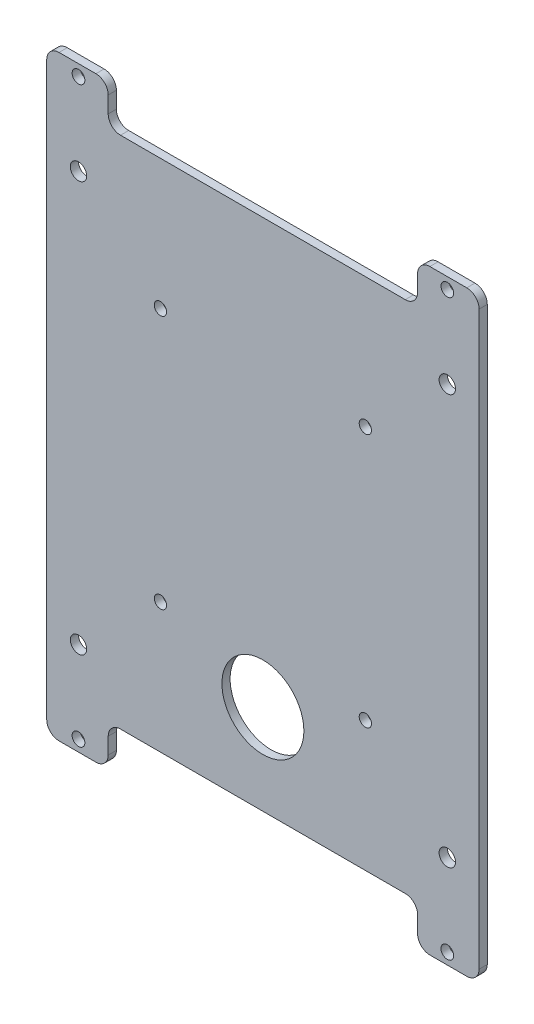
ISO-10303-21;
HEADER;
FILE_DESCRIPTION(('STEP AP214'),'2;1');
FILE_NAME('part.step','',(''),(''),'','','');
FILE_SCHEMA(('AUTOMOTIVE_DESIGN { 1 0 10303 214 1 1 1 1 }'));
ENDSEC;
DATA;
#1=APPLICATION_CONTEXT('core data for automotive mechanical design processes');
#2=APPLICATION_PROTOCOL_DEFINITION('international standard','automotive_design',2000,#1);
#3=PRODUCT_CONTEXT('',#1,'mechanical');
#4=PRODUCT('Part','Part','',(#3));
#5=PRODUCT_RELATED_PRODUCT_CATEGORY('part','',(#4));
#6=PRODUCT_DEFINITION_FORMATION('','',#4);
#7=PRODUCT_DEFINITION_CONTEXT('part definition',#1,'design');
#8=PRODUCT_DEFINITION('design','',#6,#7);
#9=PRODUCT_DEFINITION_SHAPE('','',#8);
#10=(LENGTH_UNIT() NAMED_UNIT(*) SI_UNIT(.MILLI.,.METRE.));
#11=(NAMED_UNIT(*) PLANE_ANGLE_UNIT() SI_UNIT($,.RADIAN.));
#12=(NAMED_UNIT(*) SI_UNIT($,.STERADIAN.) SOLID_ANGLE_UNIT());
#13=UNCERTAINTY_MEASURE_WITH_UNIT(LENGTH_MEASURE(1.E-05),#10,'distance_accuracy_value','');
#14=(GEOMETRIC_REPRESENTATION_CONTEXT(3) GLOBAL_UNCERTAINTY_ASSIGNED_CONTEXT((#13)) GLOBAL_UNIT_ASSIGNED_CONTEXT((#10,
#11,#12)) REPRESENTATION_CONTEXT('',''));
#15=CARTESIAN_POINT('',(0.,0.,0.));
#16=DIRECTION('',(0.,0.,1.));
#17=DIRECTION('',(1.,0.,0.));
#18=AXIS2_PLACEMENT_3D('',#15,#16,#17);
#19=CARTESIAN_POINT('',(-52.75,-72.75,-106.180271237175));
#20=DIRECTION('',(0.,-1.,0.));
#21=DIRECTION('',(0.,0.,-1.));
#22=AXIS2_PLACEMENT_3D('',#19,#20,#21);
#23=PLANE('',#22);
#24=DIRECTION('',(1.,0.,0.));
#25=VECTOR('',#24,1.);
#26=CARTESIAN_POINT('',(-52.75,-72.75,0.));
#27=LINE('',#26,#25);
#28=CARTESIAN_POINT('',(-49.75,-72.75,0.));
#29=VERTEX_POINT('',#28);
#30=CARTESIAN_POINT('',(-40.75,-72.75,0.));
#31=VERTEX_POINT('',#30);
#32=EDGE_CURVE('E219',#29,#31,#27,.T.);
#33=ORIENTED_EDGE('',*,*,#32,.T.);
#34=DIRECTION('',(0.,0.,-1.));
#35=VECTOR('',#34,1.);
#36=CARTESIAN_POINT('',(-40.75,-72.75,2.));
#37=LINE('',#36,#35);
#38=CARTESIAN_POINT('',(-40.75,-72.75,2.));
#39=VERTEX_POINT('',#38);
#40=EDGE_CURVE('E248',#31,#39,#37,.F.);
#41=ORIENTED_EDGE('',*,*,#40,.T.);
#42=DIRECTION('',(1.,0.,0.));
#43=VECTOR('',#42,1.);
#44=CARTESIAN_POINT('',(-52.75,-72.75,2.));
#45=LINE('',#44,#43);
#46=CARTESIAN_POINT('',(-49.75,-72.75,2.));
#47=VERTEX_POINT('',#46);
#48=EDGE_CURVE('E375',#47,#39,#45,.T.);
#49=ORIENTED_EDGE('',*,*,#48,.F.);
#50=DIRECTION('',(0.,0.,1.));
#51=VECTOR('',#50,1.);
#52=CARTESIAN_POINT('',(-49.75,-72.75,0.));
#53=LINE('',#52,#51);
#54=EDGE_CURVE('E246',#47,#29,#53,.F.);
#55=ORIENTED_EDGE('',*,*,#54,.T.);
#56=EDGE_LOOP('',(#33,#41,#49,#55));
#57=FACE_BOUND('',#56,.T.);
#58=ADVANCED_FACE('F36',(#57),#23,.T.);
#59=CARTESIAN_POINT('',(-52.75,72.75,-106.180271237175));
#60=DIRECTION('',(0.,1.,0.));
#61=DIRECTION('',(-1.,0.,0.));
#62=AXIS2_PLACEMENT_3D('',#59,#60,#61);
#63=PLANE('',#62);
#64=DIRECTION('',(-1.,0.,0.));
#65=VECTOR('',#64,1.);
#66=CARTESIAN_POINT('',(-52.75,72.75,2.));
#67=LINE('',#66,#65);
#68=CARTESIAN_POINT('',(-40.75,72.75,2.));
#69=VERTEX_POINT('',#68);
#70=CARTESIAN_POINT('',(-49.75,72.75,2.));
#71=VERTEX_POINT('',#70);
#72=EDGE_CURVE('E471',#69,#71,#67,.T.);
#73=ORIENTED_EDGE('',*,*,#72,.F.);
#74=DIRECTION('',(0.,0.,1.));
#75=VECTOR('',#74,1.);
#76=CARTESIAN_POINT('',(-40.75,72.75,0.));
#77=LINE('',#76,#75);
#78=CARTESIAN_POINT('',(-40.75,72.75,0.));
#79=VERTEX_POINT('',#78);
#80=EDGE_CURVE('E278',#69,#79,#77,.F.);
#81=ORIENTED_EDGE('',*,*,#80,.T.);
#82=DIRECTION('',(-1.,0.,0.));
#83=VECTOR('',#82,1.);
#84=CARTESIAN_POINT('',(-52.75,72.75,0.));
#85=LINE('',#84,#83);
#86=CARTESIAN_POINT('',(-49.75,72.75,0.));
#87=VERTEX_POINT('',#86);
#88=EDGE_CURVE('E607',#79,#87,#85,.T.);
#89=ORIENTED_EDGE('',*,*,#88,.T.);
#90=DIRECTION('',(0.,0.,1.));
#91=VECTOR('',#90,1.);
#92=CARTESIAN_POINT('',(-49.75,72.75,2.));
#93=LINE('',#92,#91);
#94=EDGE_CURVE('E275',#87,#71,#93,.T.);
#95=ORIENTED_EDGE('',*,*,#94,.T.);
#96=EDGE_LOOP('',(#73,#81,#89,#95));
#97=FACE_BOUND('',#96,.T.);
#98=ADVANCED_FACE('F501',(#97),#63,.T.);
#99=CARTESIAN_POINT('',(0.,0.,2.));
#100=DIRECTION('',(0.,0.,-1.));
#101=DIRECTION('',(-1.,0.,0.));
#102=AXIS2_PLACEMENT_3D('',#99,#100,#101);
#103=PLANE('',#102);
#104=CARTESIAN_POINT('',(40.75,-72.75,2.));
#105=VERTEX_POINT('',#104);
#106=CARTESIAN_POINT('',(49.75,-72.75,2.));
#107=VERTEX_POINT('',#106);
#108=EDGE_CURVE('E206',#105,#107,#45,.T.);
#109=ORIENTED_EDGE('',*,*,#108,.T.);
#110=CARTESIAN_POINT('',(49.75,-69.75,2.));
#111=DIRECTION('',(0.,0.,-1.));
#112=DIRECTION('',(-1.,0.,0.));
#113=AXIS2_PLACEMENT_3D('',#110,#111,#112);
#114=CIRCLE('',#113,3.);
#115=CARTESIAN_POINT('',(52.75,-69.75,2.));
#116=VERTEX_POINT('',#115);
#117=EDGE_CURVE('E344',#107,#116,#114,.F.);
#118=ORIENTED_EDGE('',*,*,#117,.T.);
#119=DIRECTION('',(0.,1.,0.));
#120=VECTOR('',#119,1.);
#121=CARTESIAN_POINT('',(52.75,-60.75,2.));
#122=LINE('',#121,#120);
#123=CARTESIAN_POINT('',(52.75,69.75,2.));
#124=VERTEX_POINT('',#123);
#125=EDGE_CURVE('E323',#116,#124,#122,.T.);
#126=ORIENTED_EDGE('',*,*,#125,.T.);
#127=CARTESIAN_POINT('',(49.75,69.75,2.));
#128=DIRECTION('',(0.,0.,-1.));
#129=DIRECTION('',(-1.,0.,0.));
#130=AXIS2_PLACEMENT_3D('',#127,#128,#129);
#131=CIRCLE('',#130,3.);
#132=CARTESIAN_POINT('',(49.75,72.75,2.));
#133=VERTEX_POINT('',#132);
#134=EDGE_CURVE('E336',#124,#133,#131,.F.);
#135=ORIENTED_EDGE('',*,*,#134,.T.);
#136=CARTESIAN_POINT('',(40.75,72.75,2.));
#137=VERTEX_POINT('',#136);
#138=EDGE_CURVE('E463',#133,#137,#67,.T.);
#139=ORIENTED_EDGE('',*,*,#138,.T.);
#140=CARTESIAN_POINT('',(40.75,69.75,2.));
#141=DIRECTION('',(0.,0.,-1.));
#142=DIRECTION('',(-1.,0.,0.));
#143=AXIS2_PLACEMENT_3D('',#140,#141,#142);
#144=CIRCLE('',#143,3.);
#145=CARTESIAN_POINT('',(37.75,69.75,2.));
#146=VERTEX_POINT('',#145);
#147=EDGE_CURVE('E334',#137,#146,#144,.F.);
#148=ORIENTED_EDGE('',*,*,#147,.T.);
#149=DIRECTION('',(0.,1.,0.));
#150=VECTOR('',#149,1.);
#151=CARTESIAN_POINT('',(37.75,72.75,2.));
#152=LINE('',#151,#150);
#153=CARTESIAN_POINT('',(37.75,65.75,2.));
#154=VERTEX_POINT('',#153);
#155=EDGE_CURVE('E610',#154,#146,#152,.T.);
#156=ORIENTED_EDGE('',*,*,#155,.F.);
#157=CARTESIAN_POINT('',(34.75,65.75,2.));
#158=DIRECTION('',(0.,0.,-1.));
#159=DIRECTION('',(-1.,0.,0.));
#160=AXIS2_PLACEMENT_3D('',#157,#158,#159);
#161=CIRCLE('',#160,3.);
#162=CARTESIAN_POINT('',(34.75,62.75,2.));
#163=VERTEX_POINT('',#162);
#164=EDGE_CURVE('E287',#154,#163,#161,.T.);
#165=ORIENTED_EDGE('',*,*,#164,.T.);
#166=DIRECTION('',(1.,0.,0.));
#167=VECTOR('',#166,1.);
#168=CARTESIAN_POINT('',(-37.75,62.75,2.));
#169=LINE('',#168,#167);
#170=CARTESIAN_POINT('',(-34.75,62.75,2.));
#171=VERTEX_POINT('',#170);
#172=EDGE_CURVE('E298',#171,#163,#169,.T.);
#173=ORIENTED_EDGE('',*,*,#172,.F.);
#174=CARTESIAN_POINT('',(-34.75,65.75,2.));
#175=DIRECTION('',(0.,0.,-1.));
#176=DIRECTION('',(-1.,0.,0.));
#177=AXIS2_PLACEMENT_3D('',#174,#175,#176);
#178=CIRCLE('',#177,3.);
#179=CARTESIAN_POINT('',(-37.75,65.75,2.));
#180=VERTEX_POINT('',#179);
#181=EDGE_CURVE('E44',#171,#180,#178,.T.);
#182=ORIENTED_EDGE('',*,*,#181,.T.);
#183=DIRECTION('',(0.,-1.,0.));
#184=VECTOR('',#183,1.);
#185=CARTESIAN_POINT('',(-37.75,72.75,2.));
#186=LINE('',#185,#184);
#187=CARTESIAN_POINT('',(-37.75,69.75,2.));
#188=VERTEX_POINT('',#187);
#189=EDGE_CURVE('E296',#188,#180,#186,.T.);
#190=ORIENTED_EDGE('',*,*,#189,.F.);
#191=CARTESIAN_POINT('',(-40.75,69.75,2.));
#192=DIRECTION('',(0.,0.,-1.));
#193=DIRECTION('',(-1.,0.,0.));
#194=AXIS2_PLACEMENT_3D('',#191,#192,#193);
#195=CIRCLE('',#194,3.);
#196=EDGE_CURVE('E332',#188,#69,#195,.F.);
#197=ORIENTED_EDGE('',*,*,#196,.T.);
#198=ORIENTED_EDGE('',*,*,#72,.T.);
#199=CARTESIAN_POINT('',(-49.75,69.75,2.));
#200=DIRECTION('',(0.,0.,-1.));
#201=DIRECTION('',(-1.,0.,0.));
#202=AXIS2_PLACEMENT_3D('',#199,#200,#201);
#203=CIRCLE('',#202,3.);
#204=CARTESIAN_POINT('',(-52.75,69.75,2.));
#205=VERTEX_POINT('',#204);
#206=EDGE_CURVE('E330',#71,#205,#203,.F.);
#207=ORIENTED_EDGE('',*,*,#206,.T.);
#208=DIRECTION('',(0.,-1.,0.));
#209=VECTOR('',#208,1.);
#210=CARTESIAN_POINT('',(-52.75,-60.75,2.));
#211=LINE('',#210,#209);
#212=CARTESIAN_POINT('',(-52.75,-69.75,2.));
#213=VERTEX_POINT('',#212);
#214=EDGE_CURVE('E319',#205,#213,#211,.T.);
#215=ORIENTED_EDGE('',*,*,#214,.T.);
#216=CARTESIAN_POINT('',(-49.75,-69.75,2.));
#217=DIRECTION('',(0.,0.,-1.));
#218=DIRECTION('',(-1.,0.,0.));
#219=AXIS2_PLACEMENT_3D('',#216,#217,#218);
#220=CIRCLE('',#219,3.);
#221=EDGE_CURVE('E338',#213,#47,#220,.F.);
#222=ORIENTED_EDGE('',*,*,#221,.T.);
#223=ORIENTED_EDGE('',*,*,#48,.T.);
#224=CARTESIAN_POINT('',(-40.75,-69.75,2.));
#225=DIRECTION('',(0.,0.,-1.));
#226=DIRECTION('',(-1.,0.,0.));
#227=AXIS2_PLACEMENT_3D('',#224,#225,#226);
#228=CIRCLE('',#227,3.);
#229=CARTESIAN_POINT('',(-37.75,-69.75,2.));
#230=VERTEX_POINT('',#229);
#231=EDGE_CURVE('E340',#39,#230,#228,.F.);
#232=ORIENTED_EDGE('',*,*,#231,.T.);
#233=DIRECTION('',(0.,-1.,0.));
#234=VECTOR('',#233,1.);
#235=CARTESIAN_POINT('',(-37.75,-72.75,2.));
#236=LINE('',#235,#234);
#237=CARTESIAN_POINT('',(-37.75,-65.75,2.));
#238=VERTEX_POINT('',#237);
#239=EDGE_CURVE('E622',#238,#230,#236,.T.);
#240=ORIENTED_EDGE('',*,*,#239,.F.);
#241=CARTESIAN_POINT('',(-34.75,-65.75,2.));
#242=DIRECTION('',(0.,0.,-1.));
#243=DIRECTION('',(-1.,0.,0.));
#244=AXIS2_PLACEMENT_3D('',#241,#242,#243);
#245=CIRCLE('',#244,3.);
#246=CARTESIAN_POINT('',(-34.75,-62.75,2.));
#247=VERTEX_POINT('',#246);
#248=EDGE_CURVE('E283',#238,#247,#245,.T.);
#249=ORIENTED_EDGE('',*,*,#248,.T.);
#250=DIRECTION('',(-1.,0.,0.));
#251=VECTOR('',#250,1.);
#252=CARTESIAN_POINT('',(-37.75,-62.75,2.));
#253=LINE('',#252,#251);
#254=CARTESIAN_POINT('',(34.75,-62.75,2.));
#255=VERTEX_POINT('',#254);
#256=EDGE_CURVE('E625',#255,#247,#253,.T.);
#257=ORIENTED_EDGE('',*,*,#256,.F.);
#258=CARTESIAN_POINT('',(34.75,-65.75,2.));
#259=DIRECTION('',(0.,0.,-1.));
#260=DIRECTION('',(-1.,0.,0.));
#261=AXIS2_PLACEMENT_3D('',#258,#259,#260);
#262=CIRCLE('',#261,3.);
#263=CARTESIAN_POINT('',(37.75,-65.75,2.));
#264=VERTEX_POINT('',#263);
#265=EDGE_CURVE('E280',#255,#264,#262,.T.);
#266=ORIENTED_EDGE('',*,*,#265,.T.);
#267=DIRECTION('',(0.,1.,0.));
#268=VECTOR('',#267,1.);
#269=CARTESIAN_POINT('',(37.75,-72.75,2.));
#270=LINE('',#269,#268);
#271=CARTESIAN_POINT('',(37.75,-69.75,2.));
#272=VERTEX_POINT('',#271);
#273=EDGE_CURVE('E627',#272,#264,#270,.T.);
#274=ORIENTED_EDGE('',*,*,#273,.F.);
#275=CARTESIAN_POINT('',(40.75,-69.75,2.));
#276=DIRECTION('',(0.,0.,-1.));
#277=DIRECTION('',(-1.,0.,0.));
#278=AXIS2_PLACEMENT_3D('',#275,#276,#277);
#279=CIRCLE('',#278,3.);
#280=EDGE_CURVE('E342',#272,#105,#279,.F.);
#281=ORIENTED_EDGE('',*,*,#280,.T.);
#282=EDGE_LOOP('',(#109,#118,#126,#135,#139,#148,#156,#165,#173,#182,#190,#197,#198,#207,#215,
#222,#223,#232,#240,#249,#257,#266,#274,#281));
#283=FACE_BOUND('',#282,.T.);
#284=CARTESIAN_POINT('',(-45.,50.,2.));
#285=DIRECTION('',(0.,0.,1.));
#286=DIRECTION('',(1.,0.,0.));
#287=AXIS2_PLACEMENT_3D('',#284,#285,#286);
#288=CIRCLE('',#287,2.);
#289=CARTESIAN_POINT('',(-43.,50.,2.));
#290=VERTEX_POINT('',#289);
#291=EDGE_CURVE('E445',#290,#290,#288,.T.);
#292=ORIENTED_EDGE('',*,*,#291,.F.);
#293=EDGE_LOOP('',(#292));
#294=FACE_BOUND('',#293,.T.);
#295=CARTESIAN_POINT('',(-25.,31.,2.));
#296=DIRECTION('',(0.,0.,1.));
#297=DIRECTION('',(1.,0.,0.));
#298=AXIS2_PLACEMENT_3D('',#295,#296,#297);
#299=CIRCLE('',#298,1.5);
#300=CARTESIAN_POINT('',(-23.5,31.,2.));
#301=VERTEX_POINT('',#300);
#302=EDGE_CURVE('E439',#301,#301,#299,.T.);
#303=ORIENTED_EDGE('',*,*,#302,.F.);
#304=EDGE_LOOP('',(#303));
#305=FACE_BOUND('',#304,.T.);
#306=CARTESIAN_POINT('',(0.,-40.75,2.));
#307=DIRECTION('',(0.,0.,1.));
#308=DIRECTION('',(1.,0.,0.));
#309=AXIS2_PLACEMENT_3D('',#306,#307,#308);
#310=CIRCLE('',#309,10.);
#311=CARTESIAN_POINT('',(10.,-40.75,2.));
#312=VERTEX_POINT('',#311);
#313=EDGE_CURVE('E433',#312,#312,#310,.T.);
#314=ORIENTED_EDGE('',*,*,#313,.F.);
#315=EDGE_LOOP('',(#314));
#316=FACE_BOUND('',#315,.T.);
#317=CARTESIAN_POINT('',(45.,50.,2.));
#318=DIRECTION('',(0.,0.,1.));
#319=DIRECTION('',(1.,0.,0.));
#320=AXIS2_PLACEMENT_3D('',#317,#318,#319);
#321=CIRCLE('',#320,2.);
#322=CARTESIAN_POINT('',(47.,50.,2.));
#323=VERTEX_POINT('',#322);
#324=EDGE_CURVE('E427',#323,#323,#321,.T.);
#325=ORIENTED_EDGE('',*,*,#324,.F.);
#326=EDGE_LOOP('',(#325));
#327=FACE_BOUND('',#326,.T.);
#328=CARTESIAN_POINT('',(45.000000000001,-50.,2.));
#329=DIRECTION('',(0.,0.,1.));
#330=DIRECTION('',(1.,0.,0.));
#331=AXIS2_PLACEMENT_3D('',#328,#329,#330);
#332=CIRCLE('',#331,2.);
#333=CARTESIAN_POINT('',(47.000000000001,-50.,2.));
#334=VERTEX_POINT('',#333);
#335=EDGE_CURVE('E421',#334,#334,#332,.T.);
#336=ORIENTED_EDGE('',*,*,#335,.F.);
#337=EDGE_LOOP('',(#336));
#338=FACE_BOUND('',#337,.T.);
#339=CARTESIAN_POINT('',(-44.999999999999,-50.,2.));
#340=DIRECTION('',(0.,0.,1.));
#341=DIRECTION('',(1.,0.,0.));
#342=AXIS2_PLACEMENT_3D('',#339,#340,#341);
#343=CIRCLE('',#342,2.);
#344=CARTESIAN_POINT('',(-42.999999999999,-50.,2.));
#345=VERTEX_POINT('',#344);
#346=EDGE_CURVE('E415',#345,#345,#343,.T.);
#347=ORIENTED_EDGE('',*,*,#346,.F.);
#348=EDGE_LOOP('',(#347));
#349=FACE_BOUND('',#348,.T.);
#350=CARTESIAN_POINT('',(25.,31.,2.));
#351=DIRECTION('',(0.,0.,1.));
#352=DIRECTION('',(1.,0.,0.));
#353=AXIS2_PLACEMENT_3D('',#350,#351,#352);
#354=CIRCLE('',#353,1.5);
#355=CARTESIAN_POINT('',(26.5,31.,2.));
#356=VERTEX_POINT('',#355);
#357=EDGE_CURVE('E409',#356,#356,#354,.T.);
#358=ORIENTED_EDGE('',*,*,#357,.F.);
#359=EDGE_LOOP('',(#358));
#360=FACE_BOUND('',#359,.T.);
#361=CARTESIAN_POINT('',(25.0000000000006,-31.,2.));
#362=DIRECTION('',(0.,0.,1.));
#363=DIRECTION('',(1.,0.,0.));
#364=AXIS2_PLACEMENT_3D('',#361,#362,#363);
#365=CIRCLE('',#364,1.5);
#366=CARTESIAN_POINT('',(26.5000000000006,-31.,2.));
#367=VERTEX_POINT('',#366);
#368=EDGE_CURVE('E403',#367,#367,#365,.T.);
#369=ORIENTED_EDGE('',*,*,#368,.F.);
#370=EDGE_LOOP('',(#369));
#371=FACE_BOUND('',#370,.T.);
#372=CARTESIAN_POINT('',(-24.9999999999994,-31.,2.));
#373=DIRECTION('',(0.,0.,1.));
#374=DIRECTION('',(1.,0.,0.));
#375=AXIS2_PLACEMENT_3D('',#372,#373,#374);
#376=CIRCLE('',#375,1.5);
#377=CARTESIAN_POINT('',(-23.4999999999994,-31.,2.));
#378=VERTEX_POINT('',#377);
#379=EDGE_CURVE('E397',#378,#378,#376,.T.);
#380=ORIENTED_EDGE('',*,*,#379,.F.);
#381=EDGE_LOOP('',(#380));
#382=FACE_BOUND('',#381,.T.);
#383=CARTESIAN_POINT('',(45.000000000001,-70.,2.));
#384=DIRECTION('',(0.,0.,1.));
#385=DIRECTION('',(1.,0.,0.));
#386=AXIS2_PLACEMENT_3D('',#383,#384,#385);
#387=CIRCLE('',#386,1.55);
#388=CARTESIAN_POINT('',(46.550000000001,-70.,2.));
#389=VERTEX_POINT('',#388);
#390=EDGE_CURVE('E384',#389,#389,#387,.T.);
#391=ORIENTED_EDGE('',*,*,#390,.F.);
#392=EDGE_LOOP('',(#391));
#393=FACE_BOUND('',#392,.T.);
#394=CARTESIAN_POINT('',(-44.999999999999,-70.,2.));
#395=DIRECTION('',(0.,0.,1.));
#396=DIRECTION('',(1.,0.,0.));
#397=AXIS2_PLACEMENT_3D('',#394,#395,#396);
#398=CIRCLE('',#397,1.55);
#399=CARTESIAN_POINT('',(-43.449999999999,-70.,2.));
#400=VERTEX_POINT('',#399);
#401=EDGE_CURVE('E389',#400,#400,#398,.T.);
#402=ORIENTED_EDGE('',*,*,#401,.F.);
#403=EDGE_LOOP('',(#402));
#404=FACE_BOUND('',#403,.T.);
#405=CARTESIAN_POINT('',(-44.999999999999,70.,2.));
#406=DIRECTION('',(0.,0.,1.));
#407=DIRECTION('',(-1.,0.,0.));
#408=AXIS2_PLACEMENT_3D('',#405,#406,#407);
#409=CIRCLE('',#408,1.55);
#410=CARTESIAN_POINT('',(-46.549999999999,70.,2.));
#411=VERTEX_POINT('',#410);
#412=EDGE_CURVE('E475',#411,#411,#409,.T.);
#413=ORIENTED_EDGE('',*,*,#412,.F.);
#414=EDGE_LOOP('',(#413));
#415=FACE_BOUND('',#414,.T.);
#416=CARTESIAN_POINT('',(45.000000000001,70.,2.));
#417=DIRECTION('',(0.,0.,1.));
#418=DIRECTION('',(-1.,0.,0.));
#419=AXIS2_PLACEMENT_3D('',#416,#417,#418);
#420=CIRCLE('',#419,1.55);
#421=CARTESIAN_POINT('',(43.450000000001,70.,2.));
#422=VERTEX_POINT('',#421);
#423=EDGE_CURVE('E479',#422,#422,#420,.T.);
#424=ORIENTED_EDGE('',*,*,#423,.F.);
#425=EDGE_LOOP('',(#424));
#426=FACE_BOUND('',#425,.T.);
#427=ADVANCED_FACE('F294',(#283,#294,#305,#316,#327,#338,#349,#360,#371,#382,#393,#404,#415,
#426),#103,.F.);
#428=CARTESIAN_POINT('',(0.,0.,0.));
#429=DIRECTION('',(0.,0.,-1.));
#430=DIRECTION('',(-1.,0.,0.));
#431=AXIS2_PLACEMENT_3D('',#428,#429,#430);
#432=PLANE('',#431);
#433=DIRECTION('',(0.,1.,0.));
#434=VECTOR('',#433,1.);
#435=CARTESIAN_POINT('',(52.75,-60.75,0.));
#436=LINE('',#435,#434);
#437=CARTESIAN_POINT('',(52.75,-69.75,0.));
#438=VERTEX_POINT('',#437);
#439=CARTESIAN_POINT('',(52.75,69.75,0.));
#440=VERTEX_POINT('',#439);
#441=EDGE_CURVE('E371',#438,#440,#436,.T.);
#442=ORIENTED_EDGE('',*,*,#441,.F.);
#443=CARTESIAN_POINT('',(49.75,-69.75,0.));
#444=DIRECTION('',(0.,0.,-1.));
#445=DIRECTION('',(-1.,0.,0.));
#446=AXIS2_PLACEMENT_3D('',#443,#444,#445);
#447=CIRCLE('',#446,3.);
#448=CARTESIAN_POINT('',(49.75,-72.75,0.));
#449=VERTEX_POINT('',#448);
#450=EDGE_CURVE('E218',#438,#449,#447,.T.);
#451=ORIENTED_EDGE('',*,*,#450,.T.);
#452=CARTESIAN_POINT('',(40.75,-72.75,0.));
#453=VERTEX_POINT('',#452);
#454=EDGE_CURVE('E203',#453,#449,#27,.T.);
#455=ORIENTED_EDGE('',*,*,#454,.F.);
#456=CARTESIAN_POINT('',(40.75,-69.75,0.));
#457=DIRECTION('',(0.,0.,-1.));
#458=DIRECTION('',(-1.,0.,0.));
#459=AXIS2_PLACEMENT_3D('',#456,#457,#458);
#460=CIRCLE('',#459,3.);
#461=CARTESIAN_POINT('',(37.75,-69.75,0.));
#462=VERTEX_POINT('',#461);
#463=EDGE_CURVE('E215',#453,#462,#460,.T.);
#464=ORIENTED_EDGE('',*,*,#463,.T.);
#465=DIRECTION('',(0.,-1.,0.));
#466=VECTOR('',#465,1.);
#467=CARTESIAN_POINT('',(37.75,0.,0.));
#468=LINE('',#467,#466);
#469=CARTESIAN_POINT('',(37.75,-65.75,0.));
#470=VERTEX_POINT('',#469);
#471=EDGE_CURVE('E620',#470,#462,#468,.T.);
#472=ORIENTED_EDGE('',*,*,#471,.F.);
#473=CARTESIAN_POINT('',(34.75,-65.75,0.));
#474=DIRECTION('',(0.,0.,-1.));
#475=DIRECTION('',(-1.,0.,0.));
#476=AXIS2_PLACEMENT_3D('',#473,#474,#475);
#477=CIRCLE('',#476,3.);
#478=CARTESIAN_POINT('',(34.75,-62.75,0.));
#479=VERTEX_POINT('',#478);
#480=EDGE_CURVE('E51',#470,#479,#477,.F.);
#481=ORIENTED_EDGE('',*,*,#480,.T.);
#482=DIRECTION('',(1.,0.,0.));
#483=VECTOR('',#482,1.);
#484=CARTESIAN_POINT('',(0.,-62.75,0.));
#485=LINE('',#484,#483);
#486=CARTESIAN_POINT('',(-34.75,-62.75,0.));
#487=VERTEX_POINT('',#486);
#488=EDGE_CURVE('E210',#487,#479,#485,.T.);
#489=ORIENTED_EDGE('',*,*,#488,.F.);
#490=CARTESIAN_POINT('',(-34.75,-65.75,0.));
#491=DIRECTION('',(0.,0.,-1.));
#492=DIRECTION('',(-1.,0.,0.));
#493=AXIS2_PLACEMENT_3D('',#490,#491,#492);
#494=CIRCLE('',#493,3.);
#495=CARTESIAN_POINT('',(-37.75,-65.75,0.));
#496=VERTEX_POINT('',#495);
#497=EDGE_CURVE('E285',#487,#496,#494,.F.);
#498=ORIENTED_EDGE('',*,*,#497,.T.);
#499=DIRECTION('',(0.,1.,0.));
#500=VECTOR('',#499,1.);
#501=CARTESIAN_POINT('',(-37.75,0.,0.));
#502=LINE('',#501,#500);
#503=CARTESIAN_POINT('',(-37.75,-69.75,0.));
#504=VERTEX_POINT('',#503);
#505=EDGE_CURVE('E307',#504,#496,#502,.T.);
#506=ORIENTED_EDGE('',*,*,#505,.F.);
#507=CARTESIAN_POINT('',(-40.75,-69.75,0.));
#508=DIRECTION('',(0.,0.,-1.));
#509=DIRECTION('',(-1.,0.,0.));
#510=AXIS2_PLACEMENT_3D('',#507,#508,#509);
#511=CIRCLE('',#510,3.);
#512=EDGE_CURVE('E226',#504,#31,#511,.T.);
#513=ORIENTED_EDGE('',*,*,#512,.T.);
#514=ORIENTED_EDGE('',*,*,#32,.F.);
#515=CARTESIAN_POINT('',(-49.75,-69.75,0.));
#516=DIRECTION('',(0.,0.,-1.));
#517=DIRECTION('',(-1.,0.,0.));
#518=AXIS2_PLACEMENT_3D('',#515,#516,#517);
#519=CIRCLE('',#518,3.);
#520=CARTESIAN_POINT('',(-52.75,-69.75,0.));
#521=VERTEX_POINT('',#520);
#522=EDGE_CURVE('E230',#29,#521,#519,.T.);
#523=ORIENTED_EDGE('',*,*,#522,.T.);
#524=DIRECTION('',(0.,-1.,0.));
#525=VECTOR('',#524,1.);
#526=CARTESIAN_POINT('',(-52.75,-60.75,0.));
#527=LINE('',#526,#525);
#528=CARTESIAN_POINT('',(-52.75,69.75,0.));
#529=VERTEX_POINT('',#528);
#530=EDGE_CURVE('E326',#529,#521,#527,.T.);
#531=ORIENTED_EDGE('',*,*,#530,.F.);
#532=CARTESIAN_POINT('',(-49.75,69.75,0.));
#533=DIRECTION('',(0.,0.,-1.));
#534=DIRECTION('',(-1.,0.,0.));
#535=AXIS2_PLACEMENT_3D('',#532,#533,#534);
#536=CIRCLE('',#535,3.);
#537=EDGE_CURVE('E351',#529,#87,#536,.T.);
#538=ORIENTED_EDGE('',*,*,#537,.T.);
#539=ORIENTED_EDGE('',*,*,#88,.F.);
#540=CARTESIAN_POINT('',(-40.75,69.75,0.));
#541=DIRECTION('',(0.,0.,-1.));
#542=DIRECTION('',(-1.,0.,0.));
#543=AXIS2_PLACEMENT_3D('',#540,#541,#542);
#544=CIRCLE('',#543,3.);
#545=CARTESIAN_POINT('',(-37.75,69.75,0.));
#546=VERTEX_POINT('',#545);
#547=EDGE_CURVE('E353',#79,#546,#544,.T.);
#548=ORIENTED_EDGE('',*,*,#547,.T.);
#549=DIRECTION('',(0.,1.,0.));
#550=VECTOR('',#549,1.);
#551=CARTESIAN_POINT('',(-37.75,0.,0.));
#552=LINE('',#551,#550);
#553=CARTESIAN_POINT('',(-37.75,65.75,0.));
#554=VERTEX_POINT('',#553);
#555=EDGE_CURVE('E315',#554,#546,#552,.T.);
#556=ORIENTED_EDGE('',*,*,#555,.F.);
#557=CARTESIAN_POINT('',(-34.75,65.75,0.));
#558=DIRECTION('',(0.,0.,-1.));
#559=DIRECTION('',(-1.,0.,0.));
#560=AXIS2_PLACEMENT_3D('',#557,#558,#559);
#561=CIRCLE('',#560,3.);
#562=CARTESIAN_POINT('',(-34.75,62.75,0.));
#563=VERTEX_POINT('',#562);
#564=EDGE_CURVE('E11',#554,#563,#561,.F.);
#565=ORIENTED_EDGE('',*,*,#564,.T.);
#566=DIRECTION('',(-1.,0.,0.));
#567=VECTOR('',#566,1.);
#568=CARTESIAN_POINT('',(0.,62.75,0.));
#569=LINE('',#568,#567);
#570=CARTESIAN_POINT('',(34.75,62.75,0.));
#571=VERTEX_POINT('',#570);
#572=EDGE_CURVE('E313',#571,#563,#569,.T.);
#573=ORIENTED_EDGE('',*,*,#572,.F.);
#574=CARTESIAN_POINT('',(34.75,65.75,0.));
#575=DIRECTION('',(0.,0.,-1.));
#576=DIRECTION('',(-1.,0.,0.));
#577=AXIS2_PLACEMENT_3D('',#574,#575,#576);
#578=CIRCLE('',#577,3.);
#579=CARTESIAN_POINT('',(37.75,65.75,0.));
#580=VERTEX_POINT('',#579);
#581=EDGE_CURVE('E289',#571,#580,#578,.F.);
#582=ORIENTED_EDGE('',*,*,#581,.T.);
#583=DIRECTION('',(0.,-1.,0.));
#584=VECTOR('',#583,1.);
#585=CARTESIAN_POINT('',(37.75,0.,0.));
#586=LINE('',#585,#584);
#587=CARTESIAN_POINT('',(37.75,69.75,0.));
#588=VERTEX_POINT('',#587);
#589=EDGE_CURVE('E608',#588,#580,#586,.T.);
#590=ORIENTED_EDGE('',*,*,#589,.F.);
#591=CARTESIAN_POINT('',(40.75,69.75,0.));
#592=DIRECTION('',(0.,0.,-1.));
#593=DIRECTION('',(-1.,0.,0.));
#594=AXIS2_PLACEMENT_3D('',#591,#592,#593);
#595=CIRCLE('',#594,3.);
#596=CARTESIAN_POINT('',(40.75,72.75,0.));
#597=VERTEX_POINT('',#596);
#598=EDGE_CURVE('E355',#588,#597,#595,.T.);
#599=ORIENTED_EDGE('',*,*,#598,.T.);
#600=CARTESIAN_POINT('',(49.75,72.75,0.));
#601=VERTEX_POINT('',#600);
#602=EDGE_CURVE('E387',#601,#597,#85,.T.);
#603=ORIENTED_EDGE('',*,*,#602,.F.);
#604=CARTESIAN_POINT('',(49.75,69.75,0.));
#605=DIRECTION('',(0.,0.,-1.));
#606=DIRECTION('',(-1.,0.,0.));
#607=AXIS2_PLACEMENT_3D('',#604,#605,#606);
#608=CIRCLE('',#607,3.);
#609=EDGE_CURVE('E357',#601,#440,#608,.T.);
#610=ORIENTED_EDGE('',*,*,#609,.T.);
#611=EDGE_LOOP('',(#442,#451,#455,#464,#472,#481,#489,#498,#506,#513,#514,#523,#531,#538,#539,
#548,#556,#565,#573,#582,#590,#599,#603,#610));
#612=FACE_BOUND('',#611,.T.);
#613=CARTESIAN_POINT('',(25.0000000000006,-31.,0.));
#614=DIRECTION('',(0.,0.,1.));
#615=DIRECTION('',(1.,0.,0.));
#616=AXIS2_PLACEMENT_3D('',#613,#614,#615);
#617=CIRCLE('',#616,1.5);
#618=CARTESIAN_POINT('',(26.5000000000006,-31.,0.));
#619=VERTEX_POINT('',#618);
#620=EDGE_CURVE('E400',#619,#619,#617,.T.);
#621=ORIENTED_EDGE('',*,*,#620,.T.);
#622=EDGE_LOOP('',(#621));
#623=FACE_BOUND('',#622,.T.);
#624=CARTESIAN_POINT('',(-44.999999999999,-50.,0.));
#625=DIRECTION('',(0.,0.,1.));
#626=DIRECTION('',(1.,0.,0.));
#627=AXIS2_PLACEMENT_3D('',#624,#625,#626);
#628=CIRCLE('',#627,2.);
#629=CARTESIAN_POINT('',(-42.999999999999,-50.,0.));
#630=VERTEX_POINT('',#629);
#631=EDGE_CURVE('E412',#630,#630,#628,.T.);
#632=ORIENTED_EDGE('',*,*,#631,.T.);
#633=EDGE_LOOP('',(#632));
#634=FACE_BOUND('',#633,.T.);
#635=CARTESIAN_POINT('',(45.,50.,0.));
#636=DIRECTION('',(0.,0.,1.));
#637=DIRECTION('',(1.,0.,0.));
#638=AXIS2_PLACEMENT_3D('',#635,#636,#637);
#639=CIRCLE('',#638,2.);
#640=CARTESIAN_POINT('',(47.,50.,0.));
#641=VERTEX_POINT('',#640);
#642=EDGE_CURVE('E424',#641,#641,#639,.T.);
#643=ORIENTED_EDGE('',*,*,#642,.T.);
#644=EDGE_LOOP('',(#643));
#645=FACE_BOUND('',#644,.T.);
#646=CARTESIAN_POINT('',(-25.,31.,0.));
#647=DIRECTION('',(0.,0.,1.));
#648=DIRECTION('',(1.,0.,0.));
#649=AXIS2_PLACEMENT_3D('',#646,#647,#648);
#650=CIRCLE('',#649,1.5);
#651=CARTESIAN_POINT('',(-23.5,31.,0.));
#652=VERTEX_POINT('',#651);
#653=EDGE_CURVE('E436',#652,#652,#650,.T.);
#654=ORIENTED_EDGE('',*,*,#653,.T.);
#655=EDGE_LOOP('',(#654));
#656=FACE_BOUND('',#655,.T.);
#657=CARTESIAN_POINT('',(-45.,50.,0.));
#658=DIRECTION('',(0.,0.,1.));
#659=DIRECTION('',(1.,0.,0.));
#660=AXIS2_PLACEMENT_3D('',#657,#658,#659);
#661=CIRCLE('',#660,2.);
#662=CARTESIAN_POINT('',(-43.,50.,0.));
#663=VERTEX_POINT('',#662);
#664=EDGE_CURVE('E442',#663,#663,#661,.T.);
#665=ORIENTED_EDGE('',*,*,#664,.T.);
#666=EDGE_LOOP('',(#665));
#667=FACE_BOUND('',#666,.T.);
#668=CARTESIAN_POINT('',(0.,-40.75,0.));
#669=DIRECTION('',(0.,0.,1.));
#670=DIRECTION('',(1.,0.,0.));
#671=AXIS2_PLACEMENT_3D('',#668,#669,#670);
#672=CIRCLE('',#671,10.);
#673=CARTESIAN_POINT('',(10.,-40.75,0.));
#674=VERTEX_POINT('',#673);
#675=EDGE_CURVE('E430',#674,#674,#672,.T.);
#676=ORIENTED_EDGE('',*,*,#675,.T.);
#677=EDGE_LOOP('',(#676));
#678=FACE_BOUND('',#677,.T.);
#679=CARTESIAN_POINT('',(45.000000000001,-50.,0.));
#680=DIRECTION('',(0.,0.,1.));
#681=DIRECTION('',(1.,0.,0.));
#682=AXIS2_PLACEMENT_3D('',#679,#680,#681);
#683=CIRCLE('',#682,2.);
#684=CARTESIAN_POINT('',(47.000000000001,-50.,0.));
#685=VERTEX_POINT('',#684);
#686=EDGE_CURVE('E418',#685,#685,#683,.T.);
#687=ORIENTED_EDGE('',*,*,#686,.T.);
#688=EDGE_LOOP('',(#687));
#689=FACE_BOUND('',#688,.T.);
#690=CARTESIAN_POINT('',(25.,31.,0.));
#691=DIRECTION('',(0.,0.,1.));
#692=DIRECTION('',(1.,0.,0.));
#693=AXIS2_PLACEMENT_3D('',#690,#691,#692);
#694=CIRCLE('',#693,1.5);
#695=CARTESIAN_POINT('',(26.5,31.,0.));
#696=VERTEX_POINT('',#695);
#697=EDGE_CURVE('E406',#696,#696,#694,.T.);
#698=ORIENTED_EDGE('',*,*,#697,.T.);
#699=EDGE_LOOP('',(#698));
#700=FACE_BOUND('',#699,.T.);
#701=CARTESIAN_POINT('',(-24.9999999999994,-31.,0.));
#702=DIRECTION('',(0.,0.,1.));
#703=DIRECTION('',(1.,0.,0.));
#704=AXIS2_PLACEMENT_3D('',#701,#702,#703);
#705=CIRCLE('',#704,1.5);
#706=CARTESIAN_POINT('',(-23.4999999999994,-31.,0.));
#707=VERTEX_POINT('',#706);
#708=EDGE_CURVE('E395',#707,#707,#705,.T.);
#709=ORIENTED_EDGE('',*,*,#708,.T.);
#710=EDGE_LOOP('',(#709));
#711=FACE_BOUND('',#710,.T.);
#712=CARTESIAN_POINT('',(45.000000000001,-70.,0.));
#713=DIRECTION('',(0.,0.,-1.));
#714=DIRECTION('',(-1.,0.,0.));
#715=AXIS2_PLACEMENT_3D('',#712,#713,#714);
#716=CIRCLE('',#715,1.55);
#717=CARTESIAN_POINT('',(43.450000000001,-70.,0.));
#718=VERTEX_POINT('',#717);
#719=EDGE_CURVE('E379',#718,#718,#716,.F.);
#720=ORIENTED_EDGE('',*,*,#719,.T.);
#721=EDGE_LOOP('',(#720));
#722=FACE_BOUND('',#721,.T.);
#723=CARTESIAN_POINT('',(-44.999999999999,-70.,0.));
#724=DIRECTION('',(0.,0.,-1.));
#725=DIRECTION('',(-1.,0.,0.));
#726=AXIS2_PLACEMENT_3D('',#723,#724,#725);
#727=CIRCLE('',#726,1.55);
#728=CARTESIAN_POINT('',(-46.549999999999,-70.,0.));
#729=VERTEX_POINT('',#728);
#730=EDGE_CURVE('E382',#729,#729,#727,.F.);
#731=ORIENTED_EDGE('',*,*,#730,.T.);
#732=EDGE_LOOP('',(#731));
#733=FACE_BOUND('',#732,.T.);
#734=CARTESIAN_POINT('',(-44.999999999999,70.,0.));
#735=DIRECTION('',(0.,0.,-1.));
#736=DIRECTION('',(-1.,0.,0.));
#737=AXIS2_PLACEMENT_3D('',#734,#735,#736);
#738=CIRCLE('',#737,1.55);
#739=CARTESIAN_POINT('',(-46.549999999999,70.,0.));
#740=VERTEX_POINT('',#739);
#741=EDGE_CURVE('E470',#740,#740,#738,.F.);
#742=ORIENTED_EDGE('',*,*,#741,.T.);
#743=EDGE_LOOP('',(#742));
#744=FACE_BOUND('',#743,.T.);
#745=CARTESIAN_POINT('',(45.000000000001,70.,0.));
#746=DIRECTION('',(0.,0.,-1.));
#747=DIRECTION('',(-1.,0.,0.));
#748=AXIS2_PLACEMENT_3D('',#745,#746,#747);
#749=CIRCLE('',#748,1.55);
#750=CARTESIAN_POINT('',(43.450000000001,70.,0.));
#751=VERTEX_POINT('',#750);
#752=EDGE_CURVE('E220',#751,#751,#749,.F.);
#753=ORIENTED_EDGE('',*,*,#752,.T.);
#754=EDGE_LOOP('',(#753));
#755=FACE_BOUND('',#754,.T.);
#756=ADVANCED_FACE('F213',(#612,#623,#634,#645,#656,#667,#678,#689,#700,#711,#722,#733,#744,
#755),#432,.T.);
#757=CARTESIAN_POINT('',(52.75,-60.75,2.));
#758=DIRECTION('',(-1.,0.,0.));
#759=DIRECTION('',(0.,0.,1.));
#760=AXIS2_PLACEMENT_3D('',#757,#758,#759);
#761=PLANE('',#760);
#762=ORIENTED_EDGE('',*,*,#125,.F.);
#763=DIRECTION('',(0.,0.,1.));
#764=VECTOR('',#763,1.);
#765=CARTESIAN_POINT('',(52.75,-69.75,0.));
#766=LINE('',#765,#764);
#767=EDGE_CURVE('E349',#116,#438,#766,.F.);
#768=ORIENTED_EDGE('',*,*,#767,.T.);
#769=ORIENTED_EDGE('',*,*,#441,.T.);
#770=DIRECTION('',(0.,0.,1.));
#771=VECTOR('',#770,1.);
#772=CARTESIAN_POINT('',(52.75,69.75,2.));
#773=LINE('',#772,#771);
#774=EDGE_CURVE('E346',#440,#124,#773,.T.);
#775=ORIENTED_EDGE('',*,*,#774,.T.);
#776=EDGE_LOOP('',(#762,#768,#769,#775));
#777=FACE_BOUND('',#776,.T.);
#778=ADVANCED_FACE('F455',(#777),#761,.F.);
#779=CARTESIAN_POINT('',(-52.75,-60.75,2.));
#780=DIRECTION('',(1.,0.,0.));
#781=DIRECTION('',(0.,0.,-1.));
#782=AXIS2_PLACEMENT_3D('',#779,#780,#781);
#783=PLANE('',#782);
#784=ORIENTED_EDGE('',*,*,#530,.T.);
#785=DIRECTION('',(0.,0.,1.));
#786=VECTOR('',#785,1.);
#787=CARTESIAN_POINT('',(-52.75,-69.75,2.));
#788=LINE('',#787,#786);
#789=EDGE_CURVE('E252',#521,#213,#788,.T.);
#790=ORIENTED_EDGE('',*,*,#789,.T.);
#791=ORIENTED_EDGE('',*,*,#214,.F.);
#792=DIRECTION('',(0.,0.,1.));
#793=VECTOR('',#792,1.);
#794=CARTESIAN_POINT('',(-52.75,69.75,0.));
#795=LINE('',#794,#793);
#796=EDGE_CURVE('E250',#205,#529,#795,.F.);
#797=ORIENTED_EDGE('',*,*,#796,.T.);
#798=EDGE_LOOP('',(#784,#790,#791,#797));
#799=FACE_BOUND('',#798,.T.);
#800=ADVANCED_FACE('F368',(#799),#783,.F.);
#801=CARTESIAN_POINT('',(-45.,50.,2.));
#802=DIRECTION('',(0.,0.,-1.));
#803=DIRECTION('',(-1.,0.,0.));
#804=AXIS2_PLACEMENT_3D('',#801,#802,#803);
#805=CYLINDRICAL_SURFACE('',#804,2.);
#806=ORIENTED_EDGE('',*,*,#291,.T.);
#807=EDGE_LOOP('',(#806));
#808=FACE_BOUND('',#807,.T.);
#809=ORIENTED_EDGE('',*,*,#664,.F.);
#810=EDGE_LOOP('',(#809));
#811=FACE_BOUND('',#810,.T.);
#812=ADVANCED_FACE('F551',(#808,#811),#805,.F.);
#813=CARTESIAN_POINT('',(-25.,31.,2.));
#814=DIRECTION('',(0.,0.,-1.));
#815=DIRECTION('',(-1.,0.,0.));
#816=AXIS2_PLACEMENT_3D('',#813,#814,#815);
#817=CYLINDRICAL_SURFACE('',#816,1.5);
#818=ORIENTED_EDGE('',*,*,#302,.T.);
#819=EDGE_LOOP('',(#818));
#820=FACE_BOUND('',#819,.T.);
#821=ORIENTED_EDGE('',*,*,#653,.F.);
#822=EDGE_LOOP('',(#821));
#823=FACE_BOUND('',#822,.T.);
#824=ADVANCED_FACE('F547',(#820,#823),#817,.F.);
#825=CARTESIAN_POINT('',(0.,-40.75,2.));
#826=DIRECTION('',(0.,0.,-1.));
#827=DIRECTION('',(-1.,0.,0.));
#828=AXIS2_PLACEMENT_3D('',#825,#826,#827);
#829=CYLINDRICAL_SURFACE('',#828,10.);
#830=ORIENTED_EDGE('',*,*,#313,.T.);
#831=EDGE_LOOP('',(#830));
#832=FACE_BOUND('',#831,.T.);
#833=ORIENTED_EDGE('',*,*,#675,.F.);
#834=EDGE_LOOP('',(#833));
#835=FACE_BOUND('',#834,.T.);
#836=ADVANCED_FACE('F543',(#832,#835),#829,.F.);
#837=CARTESIAN_POINT('',(45.,50.,2.));
#838=DIRECTION('',(0.,0.,-1.));
#839=DIRECTION('',(-1.,0.,0.));
#840=AXIS2_PLACEMENT_3D('',#837,#838,#839);
#841=CYLINDRICAL_SURFACE('',#840,2.);
#842=ORIENTED_EDGE('',*,*,#324,.T.);
#843=EDGE_LOOP('',(#842));
#844=FACE_BOUND('',#843,.T.);
#845=ORIENTED_EDGE('',*,*,#642,.F.);
#846=EDGE_LOOP('',(#845));
#847=FACE_BOUND('',#846,.T.);
#848=ADVANCED_FACE('F539',(#844,#847),#841,.F.);
#849=CARTESIAN_POINT('',(45.000000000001,-50.,2.));
#850=DIRECTION('',(0.,0.,-1.));
#851=DIRECTION('',(-1.,0.,0.));
#852=AXIS2_PLACEMENT_3D('',#849,#850,#851);
#853=CYLINDRICAL_SURFACE('',#852,2.);
#854=ORIENTED_EDGE('',*,*,#335,.T.);
#855=EDGE_LOOP('',(#854));
#856=FACE_BOUND('',#855,.T.);
#857=ORIENTED_EDGE('',*,*,#686,.F.);
#858=EDGE_LOOP('',(#857));
#859=FACE_BOUND('',#858,.T.);
#860=ADVANCED_FACE('F535',(#856,#859),#853,.F.);
#861=CARTESIAN_POINT('',(-44.999999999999,-50.,2.));
#862=DIRECTION('',(0.,0.,-1.));
#863=DIRECTION('',(-1.,0.,0.));
#864=AXIS2_PLACEMENT_3D('',#861,#862,#863);
#865=CYLINDRICAL_SURFACE('',#864,2.);
#866=ORIENTED_EDGE('',*,*,#346,.T.);
#867=EDGE_LOOP('',(#866));
#868=FACE_BOUND('',#867,.T.);
#869=ORIENTED_EDGE('',*,*,#631,.F.);
#870=EDGE_LOOP('',(#869));
#871=FACE_BOUND('',#870,.T.);
#872=ADVANCED_FACE('F531',(#868,#871),#865,.F.);
#873=CARTESIAN_POINT('',(25.,31.,2.));
#874=DIRECTION('',(0.,0.,-1.));
#875=DIRECTION('',(-1.,0.,0.));
#876=AXIS2_PLACEMENT_3D('',#873,#874,#875);
#877=CYLINDRICAL_SURFACE('',#876,1.5);
#878=ORIENTED_EDGE('',*,*,#357,.T.);
#879=EDGE_LOOP('',(#878));
#880=FACE_BOUND('',#879,.T.);
#881=ORIENTED_EDGE('',*,*,#697,.F.);
#882=EDGE_LOOP('',(#881));
#883=FACE_BOUND('',#882,.T.);
#884=ADVANCED_FACE('F523',(#880,#883),#877,.F.);
#885=CARTESIAN_POINT('',(25.0000000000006,-31.,2.));
#886=DIRECTION('',(0.,0.,-1.));
#887=DIRECTION('',(-1.,0.,0.));
#888=AXIS2_PLACEMENT_3D('',#885,#886,#887);
#889=CYLINDRICAL_SURFACE('',#888,1.5);
#890=ORIENTED_EDGE('',*,*,#368,.T.);
#891=EDGE_LOOP('',(#890));
#892=FACE_BOUND('',#891,.T.);
#893=ORIENTED_EDGE('',*,*,#620,.F.);
#894=EDGE_LOOP('',(#893));
#895=FACE_BOUND('',#894,.T.);
#896=ADVANCED_FACE('F517',(#892,#895),#889,.F.);
#897=CARTESIAN_POINT('',(-24.9999999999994,-31.,2.));
#898=DIRECTION('',(0.,0.,-1.));
#899=DIRECTION('',(-1.,0.,0.));
#900=AXIS2_PLACEMENT_3D('',#897,#898,#899);
#901=CYLINDRICAL_SURFACE('',#900,1.5);
#902=ORIENTED_EDGE('',*,*,#379,.T.);
#903=EDGE_LOOP('',(#902));
#904=FACE_BOUND('',#903,.T.);
#905=ORIENTED_EDGE('',*,*,#708,.F.);
#906=EDGE_LOOP('',(#905));
#907=FACE_BOUND('',#906,.T.);
#908=ADVANCED_FACE('F511',(#904,#907),#901,.F.);
#909=ORIENTED_EDGE('',*,*,#454,.T.);
#910=DIRECTION('',(0.,0.,1.));
#911=VECTOR('',#910,1.);
#912=CARTESIAN_POINT('',(49.75,-72.75,2.));
#913=LINE('',#912,#911);
#914=EDGE_CURVE('E209',#449,#107,#913,.T.);
#915=ORIENTED_EDGE('',*,*,#914,.T.);
#916=ORIENTED_EDGE('',*,*,#108,.F.);
#917=DIRECTION('',(0.,0.,1.));
#918=VECTOR('',#917,1.);
#919=CARTESIAN_POINT('',(40.75,-72.75,0.));
#920=LINE('',#919,#918);
#921=EDGE_CURVE('E199',#105,#453,#920,.F.);
#922=ORIENTED_EDGE('',*,*,#921,.T.);
#923=EDGE_LOOP('',(#909,#915,#916,#922));
#924=FACE_BOUND('',#923,.T.);
#925=ADVANCED_FACE('F201',(#924),#23,.T.);
#926=CARTESIAN_POINT('',(-44.999999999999,-70.,-106.180271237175));
#927=DIRECTION('',(0.,0.,1.));
#928=DIRECTION('',(1.,0.,0.));
#929=AXIS2_PLACEMENT_3D('',#926,#927,#928);
#930=CYLINDRICAL_SURFACE('',#929,1.55);
#931=ORIENTED_EDGE('',*,*,#401,.T.);
#932=EDGE_LOOP('',(#931));
#933=FACE_BOUND('',#932,.T.);
#934=ORIENTED_EDGE('',*,*,#730,.F.);
#935=EDGE_LOOP('',(#934));
#936=FACE_BOUND('',#935,.T.);
#937=ADVANCED_FACE('F510',(#933,#936),#930,.F.);
#938=CARTESIAN_POINT('',(45.000000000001,-70.,-106.180271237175));
#939=DIRECTION('',(0.,0.,1.));
#940=DIRECTION('',(1.,0.,0.));
#941=AXIS2_PLACEMENT_3D('',#938,#939,#940);
#942=CYLINDRICAL_SURFACE('',#941,1.55);
#943=ORIENTED_EDGE('',*,*,#390,.T.);
#944=EDGE_LOOP('',(#943));
#945=FACE_BOUND('',#944,.T.);
#946=ORIENTED_EDGE('',*,*,#719,.F.);
#947=EDGE_LOOP('',(#946));
#948=FACE_BOUND('',#947,.T.);
#949=ADVANCED_FACE('F499',(#945,#948),#942,.F.);
#950=ORIENTED_EDGE('',*,*,#138,.F.);
#951=DIRECTION('',(0.,0.,1.));
#952=VECTOR('',#951,1.);
#953=CARTESIAN_POINT('',(49.75,72.75,0.));
#954=LINE('',#953,#952);
#955=EDGE_CURVE('E257',#133,#601,#954,.F.);
#956=ORIENTED_EDGE('',*,*,#955,.T.);
#957=ORIENTED_EDGE('',*,*,#602,.T.);
#958=DIRECTION('',(0.,0.,-1.));
#959=VECTOR('',#958,1.);
#960=CARTESIAN_POINT('',(40.75,72.75,2.));
#961=LINE('',#960,#959);
#962=EDGE_CURVE('E255',#597,#137,#961,.F.);
#963=ORIENTED_EDGE('',*,*,#962,.T.);
#964=EDGE_LOOP('',(#950,#956,#957,#963));
#965=FACE_BOUND('',#964,.T.);
#966=ADVANCED_FACE('F466',(#965),#63,.T.);
#967=CARTESIAN_POINT('',(45.000000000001,70.,-106.180271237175));
#968=DIRECTION('',(0.,0.,1.));
#969=DIRECTION('',(1.,0.,0.));
#970=AXIS2_PLACEMENT_3D('',#967,#968,#969);
#971=CYLINDRICAL_SURFACE('',#970,1.55);
#972=ORIENTED_EDGE('',*,*,#423,.T.);
#973=EDGE_LOOP('',(#972));
#974=FACE_BOUND('',#973,.T.);
#975=ORIENTED_EDGE('',*,*,#752,.F.);
#976=EDGE_LOOP('',(#975));
#977=FACE_BOUND('',#976,.T.);
#978=ADVANCED_FACE('F488',(#974,#977),#971,.F.);
#979=CARTESIAN_POINT('',(-44.999999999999,70.,-106.180271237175));
#980=DIRECTION('',(0.,0.,1.));
#981=DIRECTION('',(1.,0.,0.));
#982=AXIS2_PLACEMENT_3D('',#979,#980,#981);
#983=CYLINDRICAL_SURFACE('',#982,1.55);
#984=ORIENTED_EDGE('',*,*,#412,.T.);
#985=EDGE_LOOP('',(#984));
#986=FACE_BOUND('',#985,.T.);
#987=ORIENTED_EDGE('',*,*,#741,.F.);
#988=EDGE_LOOP('',(#987));
#989=FACE_BOUND('',#988,.T.);
#990=ADVANCED_FACE('F490',(#986,#989),#983,.F.);
#991=CARTESIAN_POINT('',(-37.75,72.75,-8.));
#992=DIRECTION('',(-1.,0.,0.));
#993=DIRECTION('',(0.,0.,1.));
#994=AXIS2_PLACEMENT_3D('',#991,#992,#993);
#995=PLANE('',#994);
#996=ORIENTED_EDGE('',*,*,#189,.T.);
#997=DIRECTION('',(0.,0.,1.));
#998=VECTOR('',#997,1.);
#999=CARTESIAN_POINT('',(-37.75,65.75,0.));
#1000=LINE('',#999,#998);
#1001=EDGE_CURVE('E273',#180,#554,#1000,.F.);
#1002=ORIENTED_EDGE('',*,*,#1001,.T.);
#1003=ORIENTED_EDGE('',*,*,#555,.T.);
#1004=DIRECTION('',(0.,0.,1.));
#1005=VECTOR('',#1004,1.);
#1006=CARTESIAN_POINT('',(-37.75,69.75,2.));
#1007=LINE('',#1006,#1005);
#1008=EDGE_CURVE('E270',#546,#188,#1007,.T.);
#1009=ORIENTED_EDGE('',*,*,#1008,.T.);
#1010=EDGE_LOOP('',(#996,#1002,#1003,#1009));
#1011=FACE_BOUND('',#1010,.T.);
#1012=ADVANCED_FACE('F303',(#1011),#995,.F.);
#1013=CARTESIAN_POINT('',(37.75,72.75,-8.));
#1014=DIRECTION('',(1.,0.,0.));
#1015=DIRECTION('',(0.,0.,-1.));
#1016=AXIS2_PLACEMENT_3D('',#1013,#1014,#1015);
#1017=PLANE('',#1016);
#1018=ORIENTED_EDGE('',*,*,#155,.T.);
#1019=DIRECTION('',(0.,0.,-1.));
#1020=VECTOR('',#1019,1.);
#1021=CARTESIAN_POINT('',(37.75,69.75,0.));
#1022=LINE('',#1021,#1020);
#1023=EDGE_CURVE('E262',#146,#588,#1022,.T.);
#1024=ORIENTED_EDGE('',*,*,#1023,.T.);
#1025=ORIENTED_EDGE('',*,*,#589,.T.);
#1026=DIRECTION('',(0.,0.,1.));
#1027=VECTOR('',#1026,1.);
#1028=CARTESIAN_POINT('',(37.75,65.75,2.));
#1029=LINE('',#1028,#1027);
#1030=EDGE_CURVE('E259',#580,#154,#1029,.T.);
#1031=ORIENTED_EDGE('',*,*,#1030,.T.);
#1032=EDGE_LOOP('',(#1018,#1024,#1025,#1031));
#1033=FACE_BOUND('',#1032,.T.);
#1034=ADVANCED_FACE('F649',(#1033),#1017,.F.);
#1035=CARTESIAN_POINT('',(-37.75,62.75,-8.));
#1036=DIRECTION('',(0.,-1.,0.));
#1037=DIRECTION('',(0.,0.,-1.));
#1038=AXIS2_PLACEMENT_3D('',#1035,#1036,#1037);
#1039=PLANE('',#1038);
#1040=ORIENTED_EDGE('',*,*,#172,.T.);
#1041=DIRECTION('',(0.,0.,1.));
#1042=VECTOR('',#1041,1.);
#1043=CARTESIAN_POINT('',(34.75,62.75,0.));
#1044=LINE('',#1043,#1042);
#1045=EDGE_CURVE('E268',#163,#571,#1044,.F.);
#1046=ORIENTED_EDGE('',*,*,#1045,.T.);
#1047=ORIENTED_EDGE('',*,*,#572,.T.);
#1048=DIRECTION('',(0.,0.,1.));
#1049=VECTOR('',#1048,1.);
#1050=CARTESIAN_POINT('',(-34.75,62.75,2.));
#1051=LINE('',#1050,#1049);
#1052=EDGE_CURVE('E265',#563,#171,#1051,.T.);
#1053=ORIENTED_EDGE('',*,*,#1052,.T.);
#1054=EDGE_LOOP('',(#1040,#1046,#1047,#1053));
#1055=FACE_BOUND('',#1054,.T.);
#1056=ADVANCED_FACE('F317',(#1055),#1039,.F.);
#1057=CARTESIAN_POINT('',(-37.75,-72.75,-8.));
#1058=DIRECTION('',(-1.,0.,0.));
#1059=DIRECTION('',(0.,0.,1.));
#1060=AXIS2_PLACEMENT_3D('',#1057,#1058,#1059);
#1061=PLANE('',#1060);
#1062=ORIENTED_EDGE('',*,*,#505,.T.);
#1063=DIRECTION('',(0.,0.,1.));
#1064=VECTOR('',#1063,1.);
#1065=CARTESIAN_POINT('',(-37.75,-65.75,2.));
#1066=LINE('',#1065,#1064);
#1067=EDGE_CURVE('E243',#496,#238,#1066,.T.);
#1068=ORIENTED_EDGE('',*,*,#1067,.T.);
#1069=ORIENTED_EDGE('',*,*,#239,.T.);
#1070=DIRECTION('',(0.,0.,-1.));
#1071=VECTOR('',#1070,1.);
#1072=CARTESIAN_POINT('',(-37.75,-69.75,0.));
#1073=LINE('',#1072,#1071);
#1074=EDGE_CURVE('E240',#230,#504,#1073,.T.);
#1075=ORIENTED_EDGE('',*,*,#1074,.T.);
#1076=EDGE_LOOP('',(#1062,#1068,#1069,#1075));
#1077=FACE_BOUND('',#1076,.T.);
#1078=ADVANCED_FACE('F639',(#1077),#1061,.F.);
#1079=CARTESIAN_POINT('',(-37.75,-62.75,-8.));
#1080=DIRECTION('',(0.,1.,0.));
#1081=DIRECTION('',(0.,0.,1.));
#1082=AXIS2_PLACEMENT_3D('',#1079,#1080,#1081);
#1083=PLANE('',#1082);
#1084=ORIENTED_EDGE('',*,*,#488,.T.);
#1085=DIRECTION('',(0.,0.,1.));
#1086=VECTOR('',#1085,1.);
#1087=CARTESIAN_POINT('',(34.75,-62.75,2.));
#1088=LINE('',#1087,#1086);
#1089=EDGE_CURVE('E237',#479,#255,#1088,.T.);
#1090=ORIENTED_EDGE('',*,*,#1089,.T.);
#1091=ORIENTED_EDGE('',*,*,#256,.T.);
#1092=DIRECTION('',(0.,0.,1.));
#1093=VECTOR('',#1092,1.);
#1094=CARTESIAN_POINT('',(-34.75,-62.75,0.));
#1095=LINE('',#1094,#1093);
#1096=EDGE_CURVE('E58',#247,#487,#1095,.F.);
#1097=ORIENTED_EDGE('',*,*,#1096,.T.);
#1098=EDGE_LOOP('',(#1084,#1090,#1091,#1097));
#1099=FACE_BOUND('',#1098,.T.);
#1100=ADVANCED_FACE('F634',(#1099),#1083,.F.);
#1101=CARTESIAN_POINT('',(37.75,-72.75,-8.));
#1102=DIRECTION('',(1.,0.,0.));
#1103=DIRECTION('',(0.,0.,-1.));
#1104=AXIS2_PLACEMENT_3D('',#1101,#1102,#1103);
#1105=PLANE('',#1104);
#1106=ORIENTED_EDGE('',*,*,#471,.T.);
#1107=DIRECTION('',(0.,0.,1.));
#1108=VECTOR('',#1107,1.);
#1109=CARTESIAN_POINT('',(37.75,-69.75,2.));
#1110=LINE('',#1109,#1108);
#1111=EDGE_CURVE('E225',#462,#272,#1110,.T.);
#1112=ORIENTED_EDGE('',*,*,#1111,.T.);
#1113=ORIENTED_EDGE('',*,*,#273,.T.);
#1114=DIRECTION('',(0.,0.,1.));
#1115=VECTOR('',#1114,1.);
#1116=CARTESIAN_POINT('',(37.75,-65.75,0.));
#1117=LINE('',#1116,#1115);
#1118=EDGE_CURVE('E228',#264,#470,#1117,.F.);
#1119=ORIENTED_EDGE('',*,*,#1118,.T.);
#1120=EDGE_LOOP('',(#1106,#1112,#1113,#1119));
#1121=FACE_BOUND('',#1120,.T.);
#1122=ADVANCED_FACE('F567',(#1121),#1105,.F.);
#1123=CARTESIAN_POINT('',(49.75,-69.75,-106.180271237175));
#1124=DIRECTION('',(0.,0.,-1.));
#1125=DIRECTION('',(-1.,0.,0.));
#1126=AXIS2_PLACEMENT_3D('',#1123,#1124,#1125);
#1127=CYLINDRICAL_SURFACE('',#1126,3.);
#1128=ORIENTED_EDGE('',*,*,#450,.F.);
#1129=ORIENTED_EDGE('',*,*,#767,.F.);
#1130=ORIENTED_EDGE('',*,*,#117,.F.);
#1131=ORIENTED_EDGE('',*,*,#914,.F.);
#1132=EDGE_LOOP('',(#1128,#1129,#1130,#1131));
#1133=FACE_BOUND('',#1132,.T.);
#1134=ADVANCED_FACE('F564',(#1133),#1127,.T.);
#1135=CARTESIAN_POINT('',(40.75,-69.75,-8.));
#1136=DIRECTION('',(0.,0.,-1.));
#1137=DIRECTION('',(-1.,0.,0.));
#1138=AXIS2_PLACEMENT_3D('',#1135,#1136,#1137);
#1139=CYLINDRICAL_SURFACE('',#1138,3.);
#1140=ORIENTED_EDGE('',*,*,#463,.F.);
#1141=ORIENTED_EDGE('',*,*,#921,.F.);
#1142=ORIENTED_EDGE('',*,*,#280,.F.);
#1143=ORIENTED_EDGE('',*,*,#1111,.F.);
#1144=EDGE_LOOP('',(#1140,#1141,#1142,#1143));
#1145=FACE_BOUND('',#1144,.T.);
#1146=ADVANCED_FACE('F223',(#1145),#1139,.T.);
#1147=CARTESIAN_POINT('',(34.75,-65.75,-8.));
#1148=DIRECTION('',(0.,0.,-1.));
#1149=DIRECTION('',(-1.,0.,0.));
#1150=AXIS2_PLACEMENT_3D('',#1147,#1148,#1149);
#1151=CYLINDRICAL_SURFACE('',#1150,3.);
#1152=ORIENTED_EDGE('',*,*,#480,.F.);
#1153=ORIENTED_EDGE('',*,*,#1118,.F.);
#1154=ORIENTED_EDGE('',*,*,#265,.F.);
#1155=ORIENTED_EDGE('',*,*,#1089,.F.);
#1156=EDGE_LOOP('',(#1152,#1153,#1154,#1155));
#1157=FACE_BOUND('',#1156,.T.);
#1158=ADVANCED_FACE('F571',(#1157),#1151,.F.);
#1159=CARTESIAN_POINT('',(-34.75,-65.75,-8.));
#1160=DIRECTION('',(0.,0.,-1.));
#1161=DIRECTION('',(-1.,0.,0.));
#1162=AXIS2_PLACEMENT_3D('',#1159,#1160,#1161);
#1163=CYLINDRICAL_SURFACE('',#1162,3.);
#1164=ORIENTED_EDGE('',*,*,#497,.F.);
#1165=ORIENTED_EDGE('',*,*,#1096,.F.);
#1166=ORIENTED_EDGE('',*,*,#248,.F.);
#1167=ORIENTED_EDGE('',*,*,#1067,.F.);
#1168=EDGE_LOOP('',(#1164,#1165,#1166,#1167));
#1169=FACE_BOUND('',#1168,.T.);
#1170=ADVANCED_FACE('F574',(#1169),#1163,.F.);
#1171=CARTESIAN_POINT('',(-40.75,-69.75,-8.));
#1172=DIRECTION('',(0.,0.,1.));
#1173=DIRECTION('',(1.,0.,0.));
#1174=AXIS2_PLACEMENT_3D('',#1171,#1172,#1173);
#1175=CYLINDRICAL_SURFACE('',#1174,3.);
#1176=ORIENTED_EDGE('',*,*,#231,.F.);
#1177=ORIENTED_EDGE('',*,*,#40,.F.);
#1178=ORIENTED_EDGE('',*,*,#512,.F.);
#1179=ORIENTED_EDGE('',*,*,#1074,.F.);
#1180=EDGE_LOOP('',(#1176,#1177,#1178,#1179));
#1181=FACE_BOUND('',#1180,.T.);
#1182=ADVANCED_FACE('F578',(#1181),#1175,.T.);
#1183=CARTESIAN_POINT('',(-49.75,-69.75,2.));
#1184=DIRECTION('',(0.,0.,-1.));
#1185=DIRECTION('',(-1.,0.,0.));
#1186=AXIS2_PLACEMENT_3D('',#1183,#1184,#1185);
#1187=CYLINDRICAL_SURFACE('',#1186,3.);
#1188=ORIENTED_EDGE('',*,*,#522,.F.);
#1189=ORIENTED_EDGE('',*,*,#54,.F.);
#1190=ORIENTED_EDGE('',*,*,#221,.F.);
#1191=ORIENTED_EDGE('',*,*,#789,.F.);
#1192=EDGE_LOOP('',(#1188,#1189,#1190,#1191));
#1193=FACE_BOUND('',#1192,.T.);
#1194=ADVANCED_FACE('F372',(#1193),#1187,.T.);
#1195=CARTESIAN_POINT('',(49.75,69.75,2.));
#1196=DIRECTION('',(0.,0.,-1.));
#1197=DIRECTION('',(-1.,0.,0.));
#1198=AXIS2_PLACEMENT_3D('',#1195,#1196,#1197);
#1199=CYLINDRICAL_SURFACE('',#1198,3.);
#1200=ORIENTED_EDGE('',*,*,#609,.F.);
#1201=ORIENTED_EDGE('',*,*,#955,.F.);
#1202=ORIENTED_EDGE('',*,*,#134,.F.);
#1203=ORIENTED_EDGE('',*,*,#774,.F.);
#1204=EDGE_LOOP('',(#1200,#1201,#1202,#1203));
#1205=FACE_BOUND('',#1204,.T.);
#1206=ADVANCED_FACE('F459',(#1205),#1199,.T.);
#1207=CARTESIAN_POINT('',(40.75,69.75,-8.));
#1208=DIRECTION('',(0.,0.,1.));
#1209=DIRECTION('',(1.,0.,0.));
#1210=AXIS2_PLACEMENT_3D('',#1207,#1208,#1209);
#1211=CYLINDRICAL_SURFACE('',#1210,3.);
#1212=ORIENTED_EDGE('',*,*,#147,.F.);
#1213=ORIENTED_EDGE('',*,*,#962,.F.);
#1214=ORIENTED_EDGE('',*,*,#598,.F.);
#1215=ORIENTED_EDGE('',*,*,#1023,.F.);
#1216=EDGE_LOOP('',(#1212,#1213,#1214,#1215));
#1217=FACE_BOUND('',#1216,.T.);
#1218=ADVANCED_FACE('F587',(#1217),#1211,.T.);
#1219=CARTESIAN_POINT('',(34.75,65.75,-8.));
#1220=DIRECTION('',(0.,0.,-1.));
#1221=DIRECTION('',(-1.,0.,0.));
#1222=AXIS2_PLACEMENT_3D('',#1219,#1220,#1221);
#1223=CYLINDRICAL_SURFACE('',#1222,3.);
#1224=ORIENTED_EDGE('',*,*,#581,.F.);
#1225=ORIENTED_EDGE('',*,*,#1045,.F.);
#1226=ORIENTED_EDGE('',*,*,#164,.F.);
#1227=ORIENTED_EDGE('',*,*,#1030,.F.);
#1228=EDGE_LOOP('',(#1224,#1225,#1226,#1227));
#1229=FACE_BOUND('',#1228,.T.);
#1230=ADVANCED_FACE('F590',(#1229),#1223,.F.);
#1231=CARTESIAN_POINT('',(-34.75,65.75,-8.));
#1232=DIRECTION('',(0.,0.,-1.));
#1233=DIRECTION('',(-1.,0.,0.));
#1234=AXIS2_PLACEMENT_3D('',#1231,#1232,#1233);
#1235=CYLINDRICAL_SURFACE('',#1234,3.);
#1236=ORIENTED_EDGE('',*,*,#564,.F.);
#1237=ORIENTED_EDGE('',*,*,#1001,.F.);
#1238=ORIENTED_EDGE('',*,*,#181,.F.);
#1239=ORIENTED_EDGE('',*,*,#1052,.F.);
#1240=EDGE_LOOP('',(#1236,#1237,#1238,#1239));
#1241=FACE_BOUND('',#1240,.T.);
#1242=ADVANCED_FACE('F310',(#1241),#1235,.F.);
#1243=CARTESIAN_POINT('',(-40.75,69.75,-8.));
#1244=DIRECTION('',(0.,0.,-1.));
#1245=DIRECTION('',(-1.,0.,0.));
#1246=AXIS2_PLACEMENT_3D('',#1243,#1244,#1245);
#1247=CYLINDRICAL_SURFACE('',#1246,3.);
#1248=ORIENTED_EDGE('',*,*,#547,.F.);
#1249=ORIENTED_EDGE('',*,*,#80,.F.);
#1250=ORIENTED_EDGE('',*,*,#196,.F.);
#1251=ORIENTED_EDGE('',*,*,#1008,.F.);
#1252=EDGE_LOOP('',(#1248,#1249,#1250,#1251));
#1253=FACE_BOUND('',#1252,.T.);
#1254=ADVANCED_FACE('F596',(#1253),#1247,.T.);
#1255=CARTESIAN_POINT('',(-49.75,69.75,-106.180271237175));
#1256=DIRECTION('',(0.,0.,-1.));
#1257=DIRECTION('',(-1.,0.,0.));
#1258=AXIS2_PLACEMENT_3D('',#1255,#1256,#1257);
#1259=CYLINDRICAL_SURFACE('',#1258,3.);
#1260=ORIENTED_EDGE('',*,*,#537,.F.);
#1261=ORIENTED_EDGE('',*,*,#796,.F.);
#1262=ORIENTED_EDGE('',*,*,#206,.F.);
#1263=ORIENTED_EDGE('',*,*,#94,.F.);
#1264=EDGE_LOOP('',(#1260,#1261,#1262,#1263));
#1265=FACE_BOUND('',#1264,.T.);
#1266=ADVANCED_FACE('F38',(#1265),#1259,.T.);
#1267=CLOSED_SHELL('',(#58,#98,#427,#756,#778,#800,#812,#824,#836,#848,#860,#872,#884,#896,#908,
#925,#937,#949,#966,#978,#990,#1012,#1034,#1056,#1078,#1100,#1122,#1134,#1146,#1158,#1170,#1182,
#1194,#1206,#1218,#1230,#1242,#1254,#1266));
#1268=MANIFOLD_SOLID_BREP('B2',#1267);
#1269=ADVANCED_BREP_SHAPE_REPRESENTATION('',(#18,#1268),#14);
#1270=SHAPE_DEFINITION_REPRESENTATION(#9,#1269);
ENDSEC;
END-ISO-10303-21;
